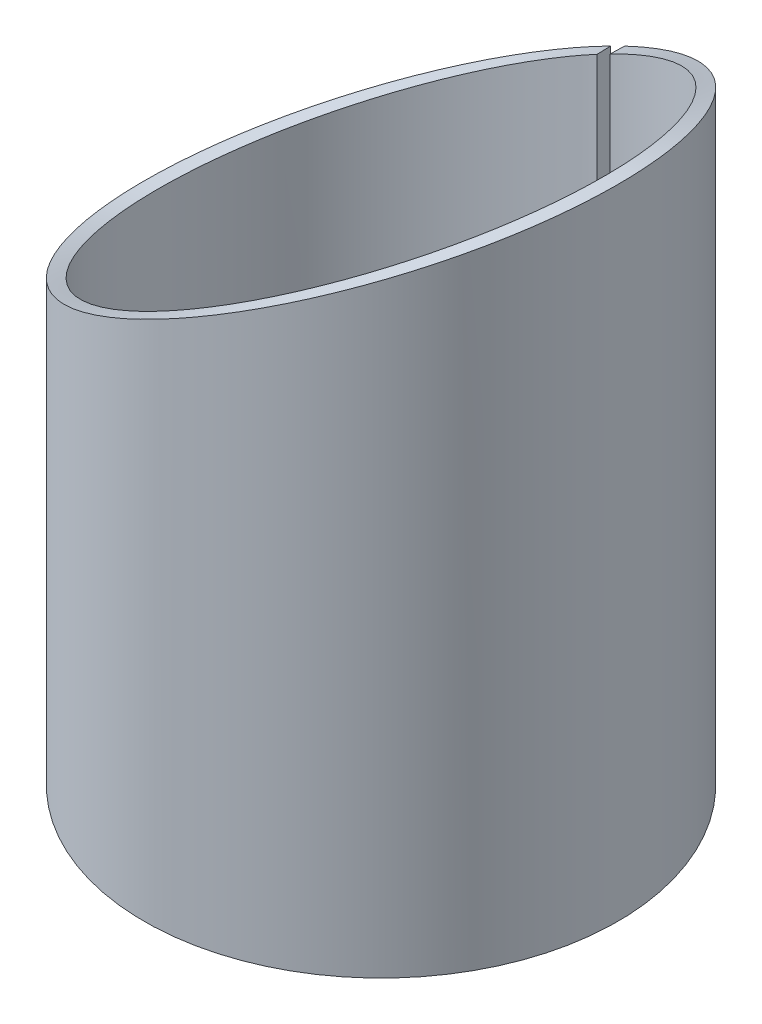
ISO-10303-21;
HEADER;
FILE_DESCRIPTION(('STEP AP214'),'2;1');
FILE_NAME('part.step','',(''),(''),'','','');
FILE_SCHEMA(('AUTOMOTIVE_DESIGN { 1 0 10303 214 1 1 1 1 }'));
ENDSEC;
DATA;
#1=APPLICATION_CONTEXT('core data for automotive mechanical design processes');
#2=APPLICATION_PROTOCOL_DEFINITION('international standard','automotive_design',2000,#1);
#3=PRODUCT_CONTEXT('',#1,'mechanical');
#4=PRODUCT('Part','Part','',(#3));
#5=PRODUCT_RELATED_PRODUCT_CATEGORY('part','',(#4));
#6=PRODUCT_DEFINITION_FORMATION('','',#4);
#7=PRODUCT_DEFINITION_CONTEXT('part definition',#1,'design');
#8=PRODUCT_DEFINITION('design','',#6,#7);
#9=PRODUCT_DEFINITION_SHAPE('','',#8);
#10=(LENGTH_UNIT() NAMED_UNIT(*) SI_UNIT(.MILLI.,.METRE.));
#11=(NAMED_UNIT(*) PLANE_ANGLE_UNIT() SI_UNIT($,.RADIAN.));
#12=(NAMED_UNIT(*) SI_UNIT($,.STERADIAN.) SOLID_ANGLE_UNIT());
#13=UNCERTAINTY_MEASURE_WITH_UNIT(LENGTH_MEASURE(1.E-05),#10,'distance_accuracy_value','');
#14=(GEOMETRIC_REPRESENTATION_CONTEXT(3) GLOBAL_UNCERTAINTY_ASSIGNED_CONTEXT((#13)) GLOBAL_UNIT_ASSIGNED_CONTEXT((#10,
#11,#12)) REPRESENTATION_CONTEXT('',''));
#15=CARTESIAN_POINT('',(0.,0.,0.));
#16=DIRECTION('',(0.,0.,1.));
#17=DIRECTION('',(1.,0.,0.));
#18=AXIS2_PLACEMENT_3D('',#15,#16,#17);
#19=CARTESIAN_POINT('',(36.5870512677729,-65.4896522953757,0.));
#20=DIRECTION('',(0.,-1.,0.));
#21=DIRECTION('',(0.,0.,-1.));
#22=AXIS2_PLACEMENT_3D('',#19,#20,#21);
#23=PLANE('',#22);
#24=DIRECTION('',(-0.0294512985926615,0.,-0.999566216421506));
#25=VECTOR('',#24,1.);
#26=CARTESIAN_POINT('',(36.1165025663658,-65.4896522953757,-15.970249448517));
#27=LINE('',#26,#25);
#28=CARTESIAN_POINT('',(36.1165025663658,-65.4896522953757,-15.970249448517));
#29=VERTEX_POINT('',#28);
#30=CARTESIAN_POINT('',(36.0870512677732,-65.4896522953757,-16.9698156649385));
#31=VERTEX_POINT('',#30);
#32=EDGE_CURVE('E13',#29,#31,#27,.T.);
#33=ORIENTED_EDGE('',*,*,#32,.F.);
#34=CARTESIAN_POINT('',(36.5870512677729,-65.4896522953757,0.));
#35=DIRECTION('',(0.,1.,0.));
#36=DIRECTION('',(0.,0.,1.));
#37=AXIS2_PLACEMENT_3D('',#34,#35,#36);
#38=CIRCLE('',#37,15.9771800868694);
#39=CARTESIAN_POINT('',(37.0575999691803,-65.4896522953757,-15.970249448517));
#40=VERTEX_POINT('',#39);
#41=EDGE_CURVE('E79',#29,#40,#38,.T.);
#42=ORIENTED_EDGE('',*,*,#41,.T.);
#43=DIRECTION('',(0.0294512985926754,0.,-0.999566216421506));
#44=VECTOR('',#43,1.);
#45=CARTESIAN_POINT('',(37.0575999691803,-65.4896522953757,-15.970249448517));
#46=LINE('',#45,#44);
#47=CARTESIAN_POINT('',(37.0870512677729,-65.4896522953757,-16.9698156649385));
#48=VERTEX_POINT('',#47);
#49=EDGE_CURVE('E48',#40,#48,#46,.T.);
#50=ORIENTED_EDGE('',*,*,#49,.T.);
#51=CARTESIAN_POINT('',(36.5870512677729,-65.4896522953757,0.));
#52=DIRECTION('',(0.,1.,0.));
#53=DIRECTION('',(0.,0.,1.));
#54=AXIS2_PLACEMENT_3D('',#51,#52,#53);
#55=CIRCLE('',#54,16.9771800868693);
#56=EDGE_CURVE('E81',#31,#48,#55,.T.);
#57=ORIENTED_EDGE('',*,*,#56,.F.);
#58=EDGE_LOOP('',(#33,#42,#50,#57));
#59=FACE_BOUND('',#58,.T.);
#60=ADVANCED_FACE('F36',(#59),#23,.T.);
#61=CARTESIAN_POINT('',(37.0575999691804,-46.6627139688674,-15.970249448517));
#62=DIRECTION('',(0.999566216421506,0.,0.0294512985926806));
#63=DIRECTION('',(0.,-1.,0.));
#64=AXIS2_PLACEMENT_3D('',#61,#62,#63);
#65=PLANE('',#64);
#66=ORIENTED_EDGE('',*,*,#49,.F.);
#67=DIRECTION('',(0.,-1.,0.));
#68=VECTOR('',#67,1.);
#69=CARTESIAN_POINT('',(37.0575999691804,-27.8357756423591,-15.970249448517));
#70=LINE('',#69,#68);
#71=CARTESIAN_POINT('',(37.0575999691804,-27.8357756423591,-15.970249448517));
#72=VERTEX_POINT('',#71);
#73=EDGE_CURVE('E88',#72,#40,#70,.T.);
#74=ORIENTED_EDGE('',*,*,#73,.F.);
#75=CARTESIAN_POINT('',(37.0870512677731,-27.8357756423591,-16.9698156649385));
#76=CARTESIAN_POINT('',(37.0575999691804,-27.8357756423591,-15.970249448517));
#77=B_SPLINE_CURVE_WITH_KNOTS('',1,(#75,#76),.UNSPECIFIED.,.F.,.F.,(2,2),(0.,1.),.UNSPECIFIED.);
#78=CARTESIAN_POINT('',(37.087051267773,-27.8357756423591,-16.9698156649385));
#79=VERTEX_POINT('',#78);
#80=EDGE_CURVE('E154',#72,#79,#77,.F.);
#81=ORIENTED_EDGE('',*,*,#80,.T.);
#82=DIRECTION('',(0.,1.,0.));
#83=VECTOR('',#82,1.);
#84=CARTESIAN_POINT('',(37.087051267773,-175.026799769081,-16.9698156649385));
#85=LINE('',#84,#83);
#86=EDGE_CURVE('E95',#79,#48,#85,.F.);
#87=ORIENTED_EDGE('',*,*,#86,.T.);
#88=EDGE_LOOP('',(#66,#74,#81,#87));
#89=FACE_BOUND('',#88,.T.);
#90=ADVANCED_FACE('F126',(#89),#65,.F.);
#91=CARTESIAN_POINT('',(36.0870512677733,-28.3288347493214,-16.9698156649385));
#92=CARTESIAN_POINT('',(35.4575269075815,-28.6391983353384,-16.951267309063));
#93=CARTESIAN_POINT('',(34.8914483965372,-28.9179611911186,-16.8998638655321));
#94=CARTESIAN_POINT('',(33.8883744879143,-29.4125509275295,-16.7689478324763));
#95=CARTESIAN_POINT('',(33.4513460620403,-29.6283335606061,-16.6894524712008));
#96=CARTESIAN_POINT('',(32.9843137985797,-29.8586715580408,-16.5907817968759));
#97=CARTESIAN_POINT('',(32.8946606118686,-29.9028679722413,-16.5710409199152));
#98=CARTESIAN_POINT('',(32.7148804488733,-29.9914963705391,-16.5299558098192));
#99=CARTESIAN_POINT('',(32.6257955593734,-30.0354097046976,-16.50882671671));
#100=CARTESIAN_POINT('',(32.3609694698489,-30.1659471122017,-16.4437807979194));
#101=CARTESIAN_POINT('',(32.187657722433,-30.2513685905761,-16.3982058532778));
#102=CARTESIAN_POINT('',(31.6775107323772,-30.5028226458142,-16.2556376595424));
#103=CARTESIAN_POINT('',(31.3504757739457,-30.6640448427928,-16.1528101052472));
#104=CARTESIAN_POINT('',(30.7225972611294,-30.9736615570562,-15.9355946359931));
#105=CARTESIAN_POINT('',(30.4217512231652,-31.1220560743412,-15.8212073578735));
#106=CARTESIAN_POINT('',(29.9899044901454,-31.3350270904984,-15.6437373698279));
#107=CARTESIAN_POINT('',(29.8491393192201,-31.4044356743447,-15.5835941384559));
#108=CARTESIAN_POINT('',(29.5705018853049,-31.5418158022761,-15.4601390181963));
#109=CARTESIAN_POINT('',(29.4330782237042,-31.609566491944,-15.3970071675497));
#110=CARTESIAN_POINT('',(28.7554859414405,-31.9436230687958,-15.074862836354));
#111=CARTESIAN_POINT('',(28.2439757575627,-32.1958383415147,-14.7964419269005));
#112=CARTESIAN_POINT('',(27.2820347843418,-32.6702089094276,-14.2112023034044));
#113=CARTESIAN_POINT('',(26.8322932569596,-32.891907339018,-13.9052464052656));
#114=CARTESIAN_POINT('',(25.9756725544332,-33.3142335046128,-13.2631000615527));
#115=CARTESIAN_POINT('',(25.5710340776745,-33.5137812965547,-12.928124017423));
#116=CARTESIAN_POINT('',(24.8088456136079,-33.8896462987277,-12.2377651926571));
#117=CARTESIAN_POINT('',(24.4518657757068,-34.0655998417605,-11.8831635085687));
#118=CARTESIAN_POINT('',(23.7766371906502,-34.3984672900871,-11.1519322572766));
#119=CARTESIAN_POINT('',(23.4593308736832,-34.5549298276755,-10.7760411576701));
#120=CARTESIAN_POINT('',(22.8652604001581,-34.8479125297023,-10.0086243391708));
#121=CARTESIAN_POINT('',(22.5889416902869,-34.9841828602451,-9.61781988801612));
#122=CARTESIAN_POINT('',(22.0738791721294,-35.2380984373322,-8.82141524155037));
#123=CARTESIAN_POINT('',(21.8349640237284,-35.3558734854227,-8.41539116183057));
#124=CARTESIAN_POINT('',(21.3945018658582,-35.5730581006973,-7.59139836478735));
#125=CARTESIAN_POINT('',(21.192953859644,-35.6724676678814,-7.17343058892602));
#126=CARTESIAN_POINT('',(20.8270154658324,-35.8529213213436,-6.3291083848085));
#127=CARTESIAN_POINT('',(20.6621983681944,-35.9341093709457,-5.90190774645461));
#128=CARTESIAN_POINT('',(19.9261370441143,-36.2964140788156,-3.73892503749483));
#129=CARTESIAN_POINT('',(19.6253272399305,-36.4451360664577,-1.93151938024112));
#130=CARTESIAN_POINT('',(19.6067390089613,-36.4546363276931,0.306638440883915));
#131=CARTESIAN_POINT('',(19.6206568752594,-36.4477153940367,0.753349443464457));
#132=CARTESIAN_POINT('',(19.6841581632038,-36.4161698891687,1.64872034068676));
#133=CARTESIAN_POINT('',(19.7337690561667,-36.3915532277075,2.0965324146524));
#134=CARTESIAN_POINT('',(19.9366967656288,-36.2911715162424,3.43599210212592));
#135=CARTESIAN_POINT('',(20.1442344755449,-36.1888747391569,4.32368711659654));
#136=CARTESIAN_POINT('',(20.5638002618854,-35.9823661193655,5.62930133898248));
#137=CARTESIAN_POINT('',(20.7216677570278,-35.9046860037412,6.06017771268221));
#138=CARTESIAN_POINT('',(21.0730235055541,-35.7316379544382,6.91021638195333));
#139=CARTESIAN_POINT('',(21.2662440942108,-35.6363511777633,7.32900446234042));
#140=CARTESIAN_POINT('',(21.690980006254,-35.4268756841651,8.15772638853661));
#141=CARTESIAN_POINT('',(21.9222328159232,-35.3128276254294,8.56691592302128));
#142=CARTESIAN_POINT('',(22.4226470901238,-35.0661108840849,9.37115803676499));
#143=CARTESIAN_POINT('',(22.6913932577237,-34.9336623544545,9.7656613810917));
#144=CARTESIAN_POINT('',(23.5570080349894,-34.5068621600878,10.9258343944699));
#145=CARTESIAN_POINT('',(24.2168527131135,-34.1814123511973,11.6723253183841));
#146=CARTESIAN_POINT('',(25.3316985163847,-33.6318631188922,12.720132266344));
#147=CARTESIAN_POINT('',(25.7266249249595,-33.4370717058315,13.059853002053));
#148=CARTESIAN_POINT('',(26.5670664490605,-33.0226198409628,13.715266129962));
#149=CARTESIAN_POINT('',(27.0120981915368,-32.8032233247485,14.0304911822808));
#150=CARTESIAN_POINT('',(27.7167227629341,-32.455872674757,14.4782373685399));
#151=CARTESIAN_POINT('',(27.9584326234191,-32.3366928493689,14.6237703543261));
#152=CARTESIAN_POINT('',(28.4598087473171,-32.0894407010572,14.9082409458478));
#153=CARTESIAN_POINT('',(28.7188854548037,-31.9616748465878,15.0467975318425));
#154=CARTESIAN_POINT('',(29.2539204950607,-31.6978635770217,15.3146773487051));
#155=CARTESIAN_POINT('',(29.5298794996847,-31.561818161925,15.4440003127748));
#156=CARTESIAN_POINT('',(29.9564418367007,-31.3515403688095,15.629577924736));
#157=CARTESIAN_POINT('',(30.1007319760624,-31.280412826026,15.6900352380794));
#158=CARTESIAN_POINT('',(30.393495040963,-31.1360878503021,15.8078905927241));
#159=CARTESIAN_POINT('',(30.5414804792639,-31.0631314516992,15.8651237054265));
#160=CARTESIAN_POINT('',(31.3038409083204,-30.68717385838,16.1472986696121));
#161=CARTESIAN_POINT('',(31.9783315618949,-30.3544757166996,16.3573084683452));
#162=CARTESIAN_POINT('',(32.9030082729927,-29.8986879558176,16.5737305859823));
#163=CARTESIAN_POINT('',(33.0920008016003,-29.8055346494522,16.6146918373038));
#164=CARTESIAN_POINT('',(33.3332675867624,-29.686598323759,16.6625314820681));
#165=CARTESIAN_POINT('',(33.3817721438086,-29.6626863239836,16.6719312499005));
#166=CARTESIAN_POINT('',(33.4792820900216,-29.6146128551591,16.6903827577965));
#167=CARTESIAN_POINT('',(33.5281515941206,-29.5905185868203,16.6994156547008));
#168=CARTESIAN_POINT('',(33.6817611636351,-29.5147499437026,16.7270666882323));
#169=CARTESIAN_POINT('',(33.7914555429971,-29.4606119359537,16.745845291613));
#170=CARTESIAN_POINT('',(34.3766186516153,-29.1717940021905,16.8393400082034));
#171=CARTESIAN_POINT('',(34.9625905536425,-28.8827303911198,16.9140032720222));
#172=CARTESIAN_POINT('',(35.8431744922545,-28.4488892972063,16.9617923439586));
#173=CARTESIAN_POINT('',(36.0266655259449,-28.3584954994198,16.9690020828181));
#174=CARTESIAN_POINT('',(36.3128587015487,-28.2174664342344,16.9752339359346));
#175=CARTESIAN_POINT('',(36.4100818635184,-28.1695503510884,16.9765465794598));
#176=CARTESIAN_POINT('',(36.6081528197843,-28.0719053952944,16.9774558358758));
#177=CARTESIAN_POINT('',(36.7084217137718,-28.0224665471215,16.9770251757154));
#178=CARTESIAN_POINT('',(37.1949740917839,-27.7826609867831,16.9707574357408));
#179=CARTESIAN_POINT('',(37.5551708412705,-27.6052643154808,16.9527983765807));
#180=CARTESIAN_POINT('',(38.5471729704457,-27.116417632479,16.8766852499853));
#181=CARTESIAN_POINT('',(39.0901523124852,-26.8483109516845,16.7972138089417));
#182=CARTESIAN_POINT('',(39.6229627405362,-26.5854164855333,16.7038794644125));
#183=CARTESIAN_POINT('',(39.7203957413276,-26.537376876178,16.6858225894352));
#184=CARTESIAN_POINT('',(39.9155527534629,-26.4411603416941,16.6479908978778));
#185=CARTESIAN_POINT('',(40.0121308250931,-26.3935503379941,16.6283799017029));
#186=CARTESIAN_POINT('',(40.2988462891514,-26.2522151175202,16.567600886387));
#187=CARTESIAN_POINT('',(40.4859636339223,-26.1599846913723,16.5244876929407));
#188=CARTESIAN_POINT('',(41.0351461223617,-25.8892725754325,16.3884522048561));
#189=CARTESIAN_POINT('',(41.3850244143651,-25.7167700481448,16.2888487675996));
#190=CARTESIAN_POINT('',(42.0522725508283,-25.3877094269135,16.077266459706));
#191=CARTESIAN_POINT('',(42.3696467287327,-25.23115133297,15.9652884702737));
#192=CARTESIAN_POINT('',(42.9723756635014,-24.933979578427,15.7339276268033));
#193=CARTESIAN_POINT('',(43.2641277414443,-24.7901731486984,15.6121118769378));
#194=CARTESIAN_POINT('',(44.1152007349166,-24.370615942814,15.2295300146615));
#195=CARTESIAN_POINT('',(44.6481068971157,-24.1078059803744,14.9525073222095));
#196=CARTESIAN_POINT('',(45.3961299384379,-23.7389332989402,14.5157893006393));
#197=CARTESIAN_POINT('',(45.6363130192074,-23.6205296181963,14.3671099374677));
#198=CARTESIAN_POINT('',(46.1049980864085,-23.3894863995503,14.0609983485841));
#199=CARTESIAN_POINT('',(46.3330520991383,-23.2770622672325,13.9037817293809));
#200=CARTESIAN_POINT('',(46.9982752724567,-22.9490823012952,13.4212964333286));
#201=CARTESIAN_POINT('',(47.4164718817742,-22.7428188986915,13.0852140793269));
#202=CARTESIAN_POINT('',(48.202781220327,-22.3550719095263,12.3924975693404));
#203=CARTESIAN_POINT('',(48.5715118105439,-22.1733416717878,12.035562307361));
#204=CARTESIAN_POINT('',(49.2688392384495,-21.8295440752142,11.2984206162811));
#205=CARTESIAN_POINT('',(49.5961982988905,-21.6681013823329,10.9192624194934));
#206=CARTESIAN_POINT('',(50.2085227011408,-21.3661282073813,10.1451325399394));
#207=CARTESIAN_POINT('',(50.49318455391,-21.2258031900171,9.7507468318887));
#208=CARTESIAN_POINT('',(51.0247040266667,-20.9637802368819,8.94493094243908));
#209=CARTESIAN_POINT('',(51.2710373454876,-20.8423246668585,8.5340737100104));
#210=CARTESIAN_POINT('',(51.7248484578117,-20.6185253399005,7.70045176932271));
#211=CARTESIAN_POINT('',(51.9320898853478,-20.5162861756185,7.27823834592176));
#212=CARTESIAN_POINT('',(52.3091819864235,-20.3304424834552,6.42320552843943));
#213=CARTESIAN_POINT('',(52.4794935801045,-20.2466185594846,5.98920633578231));
#214=CARTESIAN_POINT('',(52.9349744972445,-20.0224405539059,4.6725513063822));
#215=CARTESIAN_POINT('',(53.1645574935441,-19.909380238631,3.77526470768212));
#216=CARTESIAN_POINT('',(53.4748566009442,-19.7560429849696,1.96681654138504));
#217=CARTESIAN_POINT('',(53.5555809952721,-19.7157752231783,1.05661995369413));
#218=CARTESIAN_POINT('',(53.5715639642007,-19.7079849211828,-0.757479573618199));
#219=CARTESIAN_POINT('',(53.5067428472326,-19.7403799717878,-1.66996881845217));
#220=CARTESIAN_POINT('',(53.228599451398,-19.8777504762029,-3.48190078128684));
#221=CARTESIAN_POINT('',(53.015266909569,-19.9827259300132,-4.38132197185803));
#222=CARTESIAN_POINT('',(52.4412265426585,-20.2652572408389,-6.14226161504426));
#223=CARTESIAN_POINT('',(52.0819747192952,-20.4424593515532,-7.0018860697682));
#224=CARTESIAN_POINT('',(51.4268079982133,-20.7655410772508,-8.26013730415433));
#225=CARTESIAN_POINT('',(51.1891891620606,-20.8826826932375,-8.67368416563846));
#226=CARTESIAN_POINT('',(50.675573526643,-21.1358613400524,-9.48518680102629));
#227=CARTESIAN_POINT('',(50.3997737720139,-21.2718376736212,-9.88304034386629));
#228=CARTESIAN_POINT('',(49.8054229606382,-21.564958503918,-10.6649162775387));
#229=CARTESIAN_POINT('',(49.4873383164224,-21.7218216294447,-11.0481350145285));
#230=CARTESIAN_POINT('',(48.809181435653,-22.0561533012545,-11.7939911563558));
#231=CARTESIAN_POINT('',(48.4502143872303,-22.2330721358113,-12.15569699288));
#232=CARTESIAN_POINT('',(47.6832103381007,-22.6113103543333,-12.8596602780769));
#233=CARTESIAN_POINT('',(47.2753965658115,-22.8124393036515,-13.2014471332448));
#234=CARTESIAN_POINT('',(46.6269369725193,-23.1321474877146,-13.6930241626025));
#235=CARTESIAN_POINT('',(46.4046683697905,-23.2417193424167,-13.8533611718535));
#236=CARTESIAN_POINT('',(45.9479556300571,-23.4668679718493,-14.1659694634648));
#237=CARTESIAN_POINT('',(45.7133367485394,-23.5825443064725,-14.318406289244));
#238=CARTESIAN_POINT('',(44.9848326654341,-23.9417671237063,-14.7657278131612));
#239=CARTESIAN_POINT('',(44.4682444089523,-24.196468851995,-15.0492503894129));
#240=CARTESIAN_POINT('',(43.6470218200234,-24.6013512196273,-15.4425899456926));
#241=CARTESIAN_POINT('',(43.366591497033,-24.7396199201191,-15.5679528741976));
#242=CARTESIAN_POINT('',(42.7860350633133,-25.0259637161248,-15.8080967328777));
#243=CARTESIAN_POINT('',(42.4828001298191,-25.1755436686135,-15.9241002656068));
#244=CARTESIAN_POINT('',(41.8501419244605,-25.4875196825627,-16.1442466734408));
#245=CARTESIAN_POINT('',(41.5207161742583,-25.6499157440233,-16.2483888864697));
#246=CARTESIAN_POINT('',(41.0069968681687,-25.9031219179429,-16.392692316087));
#247=CARTESIAN_POINT('',(40.8324967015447,-25.9891259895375,-16.4388062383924));
#248=CARTESIAN_POINT('',(40.5658937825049,-26.1205351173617,-16.5046004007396));
#249=CARTESIAN_POINT('',(40.476217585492,-26.1647386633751,-16.5259688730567));
#250=CARTESIAN_POINT('',(40.2952571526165,-26.2539467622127,-16.5675125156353));
#251=CARTESIAN_POINT('',(40.204969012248,-26.298455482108,-16.5874797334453));
#252=CARTESIAN_POINT('',(39.7366236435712,-26.5294299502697,-16.6868673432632));
#253=CARTESIAN_POINT('',(39.2978448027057,-26.7460801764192,-16.7670702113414));
#254=CARTESIAN_POINT('',(38.2898063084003,-27.2431219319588,-16.8992209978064));
#255=CARTESIAN_POINT('',(37.7205122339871,-27.5234682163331,-16.9511513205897));
#256=CARTESIAN_POINT('',(37.0870512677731,-27.8357756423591,-16.9698156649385));
#257=CARTESIAN_POINT('',(36.116502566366,-28.3288347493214,-15.970249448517));
#258=CARTESIAN_POINT('',(35.5240609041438,-28.6391972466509,-15.9527937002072));
#259=CARTESIAN_POINT('',(34.991323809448,-28.9179611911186,-15.9044179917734));
#260=CARTESIAN_POINT('',(34.0473335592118,-29.4125509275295,-15.7812132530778));
#261=CARTESIAN_POINT('',(33.6360472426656,-29.6283335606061,-15.7064003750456));
#262=CARTESIAN_POINT('',(33.1965243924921,-29.8586715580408,-15.6135416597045));
#263=CARTESIAN_POINT('',(33.1121520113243,-29.9028679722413,-15.5949635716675));
#264=CARTESIAN_POINT('',(32.9429613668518,-29.9914963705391,-15.5562984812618));
#265=CARTESIAN_POINT('',(32.8591238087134,-30.0354097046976,-15.5364139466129));
#266=CARTESIAN_POINT('',(32.6098966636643,-30.1659471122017,-15.4751994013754));
#267=CARTESIAN_POINT('',(32.446793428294,-30.2513685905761,-15.4323089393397));
#268=CARTESIAN_POINT('',(31.9666954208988,-30.5028226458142,-15.2981383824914));
#269=CARTESIAN_POINT('',(31.6589236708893,-30.6640448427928,-15.2013676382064));
#270=CARTESIAN_POINT('',(31.0680288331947,-30.9736615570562,-14.9969467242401));
#271=CARTESIAN_POINT('',(30.7849034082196,-31.1220560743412,-14.8892971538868));
#272=CARTESIAN_POINT('',(30.3784935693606,-31.3350270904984,-14.7222806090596));
#273=CARTESIAN_POINT('',(30.2460198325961,-31.4044356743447,-14.6656799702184));
#274=CARTESIAN_POINT('',(29.9837948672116,-31.5418158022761,-14.549496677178));
#275=CARTESIAN_POINT('',(29.8544658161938,-31.609566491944,-14.4900834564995));
#276=CARTESIAN_POINT('',(29.2167854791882,-31.9436230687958,-14.1869142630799));
#277=CARTESIAN_POINT('',(28.7354045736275,-32.1958383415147,-13.9248930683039));
#278=CARTESIAN_POINT('',(27.8301244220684,-32.6702089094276,-13.3741255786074));
#279=CARTESIAN_POINT('',(27.4068738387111,-32.891907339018,-13.0861912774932));
#280=CARTESIAN_POINT('',(26.6007103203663,-33.3142335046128,-12.4818690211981));
#281=CARTESIAN_POINT('',(26.2199061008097,-33.5137812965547,-12.1666239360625));
#282=CARTESIAN_POINT('',(25.5026125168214,-33.8896462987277,-11.5169290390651));
#283=CARTESIAN_POINT('',(25.1666597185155,-34.0655998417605,-11.1832143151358));
#284=CARTESIAN_POINT('',(24.5312038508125,-34.3984672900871,-10.4950544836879));
#285=CARTESIAN_POINT('',(24.2325877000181,-34.5549298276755,-10.1413043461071));
#286=CARTESIAN_POINT('',(23.6735095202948,-34.8479125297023,-9.41909037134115));
#287=CARTESIAN_POINT('',(23.413466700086,-34.9841828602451,-9.05130531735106));
#288=CARTESIAN_POINT('',(22.9287427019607,-35.2380984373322,-8.30181097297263));
#289=CARTESIAN_POINT('',(22.7039002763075,-35.3558734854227,-7.91970276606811));
#290=CARTESIAN_POINT('',(22.2893824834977,-35.5730581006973,-7.14424528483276));
#291=CARTESIAN_POINT('',(22.0997061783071,-35.6724676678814,-6.75089689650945));
#292=CARTESIAN_POINT('',(21.7553225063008,-35.8529213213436,-5.9563074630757));
#293=CARTESIAN_POINT('',(21.6002135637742,-35.9341093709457,-5.5542700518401));
#294=CARTESIAN_POINT('',(20.9075081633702,-36.2964140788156,-3.51869264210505));
#295=CARTESIAN_POINT('',(20.6244168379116,-36.4451360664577,-1.81774787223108));
#296=CARTESIAN_POINT('',(20.6069235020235,-36.4546363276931,0.288576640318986));
#297=CARTESIAN_POINT('',(20.6200215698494,-36.4477153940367,0.708975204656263));
#298=CARTESIAN_POINT('',(20.6797824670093,-36.4161698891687,1.551606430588));
#299=CARTESIAN_POINT('',(20.726471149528,-36.3915532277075,1.9730412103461));
#300=CARTESIAN_POINT('',(20.9174458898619,-36.2911715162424,3.23360324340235));
#301=CARTESIAN_POINT('',(21.11275908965,-36.1888747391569,4.06901071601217));
#302=CARTESIAN_POINT('',(21.507611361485,-35.9823661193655,5.29772086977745));
#303=CARTESIAN_POINT('',(21.6561800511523,-35.9046860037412,5.70321750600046));
#304=CARTESIAN_POINT('',(21.9868400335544,-35.7316379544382,6.50318668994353));
#305=CARTESIAN_POINT('',(22.1686794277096,-35.6363511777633,6.89730706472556));
#306=CARTESIAN_POINT('',(22.5683972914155,-35.4268756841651,7.67721511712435));
#307=CARTESIAN_POINT('',(22.7860287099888,-35.3128276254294,8.0623023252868));
#308=CARTESIAN_POINT('',(23.2569672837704,-35.0661108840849,8.81917248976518));
#309=CARTESIAN_POINT('',(23.509883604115,-34.9336623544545,9.19043856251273));
#310=CARTESIAN_POINT('',(24.3245114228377,-34.5068621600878,10.2822743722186));
#311=CARTESIAN_POINT('',(24.9454895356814,-34.1814123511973,10.9847950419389));
#312=CARTESIAN_POINT('',(25.9946680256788,-33.6318631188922,11.9708834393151));
#313=CARTESIAN_POINT('',(26.3663322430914,-33.4370717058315,12.2905937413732));
#314=CARTESIAN_POINT('',(27.1572695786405,-33.0226198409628,12.907401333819));
#315=CARTESIAN_POINT('',(27.5760877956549,-32.8032233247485,13.2040588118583));
#316=CARTESIAN_POINT('',(28.2392081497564,-32.455872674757,13.6254315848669));
#317=CARTESIAN_POINT('',(28.4666806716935,-32.3366928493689,13.7623922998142));
#318=CARTESIAN_POINT('',(28.9385244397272,-32.0894407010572,14.0301068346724));
#319=CARTESIAN_POINT('',(29.1823408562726,-31.9616748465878,14.1605020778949));
#320=CARTESIAN_POINT('',(29.6858609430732,-31.6978635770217,14.4126030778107));
#321=CARTESIAN_POINT('',(29.9455652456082,-31.561818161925,14.5343085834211));
#322=CARTESIAN_POINT('',(30.3470019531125,-31.3515403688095,14.7089551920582));
#323=CARTESIAN_POINT('',(30.4827930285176,-31.280412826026,14.7658514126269));
#324=CARTESIAN_POINT('',(30.7583115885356,-31.1360878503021,14.8767647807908));
#325=CARTESIAN_POINT('',(30.8975803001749,-31.0631314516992,14.9306267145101));
#326=CARTESIAN_POINT('',(31.6150357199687,-30.68717385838,15.1961808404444));
#327=CARTESIAN_POINT('',(32.2497971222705,-30.3544757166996,15.3938205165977));
#328=CARTESIAN_POINT('',(33.1200079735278,-29.8986879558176,15.5974948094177));
#329=CARTESIAN_POINT('',(33.2978683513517,-29.8055346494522,15.6360433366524));
#330=CARTESIAN_POINT('',(33.5249238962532,-29.686598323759,15.6810651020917));
#331=CARTESIAN_POINT('',(33.5705714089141,-29.6626863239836,15.6899111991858));
#332=CARTESIAN_POINT('',(33.6623377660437,-29.6146128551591,15.7072758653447));
#333=CARTESIAN_POINT('',(33.7083287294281,-29.5905185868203,15.7157767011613));
#334=CARTESIAN_POINT('',(33.8528902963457,-29.5147499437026,15.7417990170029));
#335=CARTESIAN_POINT('',(33.9561233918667,-29.4606119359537,15.7594715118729));
#336=CARTESIAN_POINT('',(34.5068188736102,-29.1717940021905,15.847459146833));
#337=CARTESIAN_POINT('',(35.0582755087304,-28.8827303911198,15.9177245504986));
#338=CARTESIAN_POINT('',(35.8869907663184,-28.4488892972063,15.9626987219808));
#339=CARTESIAN_POINT('',(36.0596737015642,-28.3584954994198,15.9694837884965));
#340=CARTESIAN_POINT('',(36.3290093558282,-28.2174664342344,15.9753485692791));
#341=CARTESIAN_POINT('',(36.4205058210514,-28.1695503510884,15.9765838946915));
#342=CARTESIAN_POINT('',(36.6069098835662,-28.0719053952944,15.9774395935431));
#343=CARTESIAN_POINT('',(36.7012726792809,-28.0224665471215,15.9770343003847));
#344=CARTESIAN_POINT('',(37.1591658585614,-27.7826609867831,15.9711357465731));
#345=CARTESIAN_POINT('',(37.4981460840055,-27.6052643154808,15.9542345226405));
#346=CARTESIAN_POINT('',(38.4317167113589,-27.116417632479,15.8826046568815));
#347=CARTESIAN_POINT('',(38.9427131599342,-26.8483109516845,15.8078142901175));
#348=CARTESIAN_POINT('',(39.4441396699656,-26.5854164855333,15.7199775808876));
#349=CARTESIAN_POINT('',(39.5358336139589,-26.537376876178,15.7029843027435));
#350=CARTESIAN_POINT('',(39.7194953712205,-26.4411603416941,15.6673809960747));
#351=CARTESIAN_POINT('',(39.8103847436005,-26.3935503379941,15.648925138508));
#352=CARTESIAN_POINT('',(40.0802119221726,-26.2522151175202,15.5917261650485));
#353=CARTESIAN_POINT('',(40.2563075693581,-26.1599846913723,15.5511524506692));
#354=CARTESIAN_POINT('',(40.7731417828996,-25.8892725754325,15.4231298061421));
#355=CARTESIAN_POINT('',(41.1024113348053,-25.7167700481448,15.3293932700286));
#356=CARTESIAN_POINT('',(41.7303568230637,-25.3877094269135,15.1302737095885));
#357=CARTESIAN_POINT('',(42.0290368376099,-25.23115133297,15.0248915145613));
#358=CARTESIAN_POINT('',(42.596263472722,-24.933979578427,14.8071584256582));
#359=CARTESIAN_POINT('',(42.8708305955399,-24.7901731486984,14.6925179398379));
#360=CARTESIAN_POINT('',(43.6717731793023,-24.370615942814,14.3324711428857));
#361=CARTESIAN_POINT('',(44.1732897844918,-24.1078059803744,14.0717658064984));
#362=CARTESIAN_POINT('',(44.8772523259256,-23.7389332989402,13.6607716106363));
#363=CARTESIAN_POINT('',(45.1032879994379,-23.6205296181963,13.5208498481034));
#364=CARTESIAN_POINT('',(45.5443662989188,-23.3894863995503,13.2327690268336));
#365=CARTESIAN_POINT('',(45.7589873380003,-23.2770622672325,13.0848128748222));
#366=CARTESIAN_POINT('',(46.3850271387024,-22.9490823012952,12.6307472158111));
#367=CARTESIAN_POINT('',(46.7785908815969,-22.7428188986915,12.3144609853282));
#368=CARTESIAN_POINT('',(47.5185845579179,-22.3550719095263,11.6625472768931));
#369=CARTESIAN_POINT('',(47.8655959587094,-22.1733416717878,11.3266364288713));
#370=CARTESIAN_POINT('',(48.5218489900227,-21.8295440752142,10.6329142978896));
#371=CARTESIAN_POINT('',(48.8299257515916,-21.6681013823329,10.2760895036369));
#372=CARTESIAN_POINT('',(49.4061826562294,-21.3661282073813,9.5475578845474));
#373=CARTESIAN_POINT('',(49.6740771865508,-21.2258031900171,9.17640251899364));
#374=CARTESIAN_POINT('',(50.1742887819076,-20.9637802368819,8.41805127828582));
#375=CARTESIAN_POINT('',(50.4061124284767,-20.8423246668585,8.03139460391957));
#376=CARTESIAN_POINT('',(50.8331928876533,-20.6185253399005,7.24687516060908));
#377=CARTESIAN_POINT('',(51.0282272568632,-20.5162861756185,6.84953120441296));
#378=CARTESIAN_POINT('',(51.3831076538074,-20.3304424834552,6.04486204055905));
#379=CARTESIAN_POINT('',(51.5433874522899,-20.2466185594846,5.63642652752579));
#380=CARTESIAN_POINT('',(51.9720393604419,-20.0224405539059,4.39732589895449));
#381=CARTESIAN_POINT('',(52.1880993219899,-19.909380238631,3.55289181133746));
#382=CARTESIAN_POINT('',(52.4801210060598,-19.7560429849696,1.85096593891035));
#383=CARTESIAN_POINT('',(52.5560905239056,-19.7157752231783,0.994382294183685));
#384=CARTESIAN_POINT('',(52.5711320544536,-19.7079849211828,-0.712862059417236));
#385=CARTESIAN_POINT('',(52.5101290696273,-19.7403799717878,-1.57160331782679));
#386=CARTESIAN_POINT('',(52.2483690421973,-19.8777504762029,-3.27680778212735));
#387=CARTESIAN_POINT('',(52.0476023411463,-19.9827259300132,-4.12325072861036));
#388=CARTESIAN_POINT('',(51.507374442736,-20.2652572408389,-5.78046645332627));
#389=CARTESIAN_POINT('',(51.1692834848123,-20.4424593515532,-6.58945679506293));
#390=CARTESIAN_POINT('',(50.5527077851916,-20.7655410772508,-7.77359376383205));
#391=CARTESIAN_POINT('',(50.3290853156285,-20.8826826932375,-8.16278164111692));
#392=CARTESIAN_POINT('',(49.8457229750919,-21.1358613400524,-8.92648466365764));
#393=CARTESIAN_POINT('',(49.5861685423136,-21.2718376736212,-9.30090359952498));
#394=CARTESIAN_POINT('',(49.0268265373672,-21.564958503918,-10.0367250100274));
#395=CARTESIAN_POINT('',(48.7274779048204,-21.7218216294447,-10.3973711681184));
#396=CARTESIAN_POINT('',(48.0892662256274,-22.0561533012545,-11.0992944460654));
#397=CARTESIAN_POINT('',(47.7514432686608,-22.2330721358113,-11.4396948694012));
#398=CARTESIAN_POINT('',(47.0296177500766,-22.6113103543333,-12.1021928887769));
#399=CARTESIAN_POINT('',(46.6458252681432,-22.8124393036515,-12.4238476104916));
#400=CARTESIAN_POINT('',(46.0355616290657,-23.1321474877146,-12.8864694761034));
#401=CARTESIAN_POINT('',(45.8263852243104,-23.2417193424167,-13.0373622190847));
#402=CARTESIAN_POINT('',(45.3965740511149,-23.4668679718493,-13.3315570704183));
#403=CARTESIAN_POINT('',(45.1757748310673,-23.5825443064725,-13.4750149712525));
#404=CARTESIAN_POINT('',(44.490181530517,-23.9417671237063,-13.895988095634));
#405=CARTESIAN_POINT('',(44.0040216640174,-24.196468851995,-14.1628104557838));
#406=CARTESIAN_POINT('',(43.2311712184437,-24.6013512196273,-14.5329812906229));
#407=CARTESIAN_POINT('',(42.967258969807,-24.7396199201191,-14.6509600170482));
#408=CARTESIAN_POINT('',(42.4208988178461,-25.0259637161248,-14.876958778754));
#409=CARTESIAN_POINT('',(42.135525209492,-25.1755436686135,-14.9861294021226));
#410=CARTESIAN_POINT('',(41.5401322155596,-25.4875196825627,-15.1933086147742));
#411=CARTESIAN_POINT('',(41.2301104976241,-25.6499157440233,-15.291316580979));
#412=CARTESIAN_POINT('',(40.7466505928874,-25.9031219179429,-15.4271201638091));
#413=CARTESIAN_POINT('',(40.5824289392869,-25.9891259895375,-15.4705178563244));
#414=CARTESIAN_POINT('',(40.3315296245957,-26.1205351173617,-15.5324365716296));
#415=CARTESIAN_POINT('',(40.2471355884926,-26.1647386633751,-15.5525463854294));
#416=CARTESIAN_POINT('',(40.0768341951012,-26.2539467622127,-15.5916429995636));
#417=CARTESIAN_POINT('',(39.9918642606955,-26.298455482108,-15.610434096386));
#418=CARTESIAN_POINT('',(39.5511056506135,-26.5294299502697,-15.7039675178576));
#419=CARTESIAN_POINT('',(39.1381720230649,-26.7460801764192,-15.7794462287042));
#420=CARTESIAN_POINT('',(38.1895096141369,-27.2431219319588,-15.9038129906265));
#421=CARTESIAN_POINT('',(37.6537463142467,-27.5234693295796,-15.9526845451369));
#422=CARTESIAN_POINT('',(37.0575999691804,-27.8357756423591,-15.970249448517));
#423=B_SPLINE_SURFACE_WITH_KNOTS('',1,3,((#91,#92,#93,#94,#95,#96,#97,#98,#99,#100,#101,#102,
#103,#104,#105,#106,#107,#108,#109,#110,#111,#112,#113,#114,#115,#116,#117,#118,#119,#120,#121,
#122,#123,#124,#125,#126,#127,#128,#129,#130,#131,#132,#133,#134,#135,#136,#137,#138,#139,#140,
#141,#142,#143,#144,#145,#146,#147,#148,#149,#150,#151,#152,#153,#154,#155,#156,#157,#158,#159,
#160,#161,#162,#163,#164,#165,#166,#167,#168,#169,#170,#171,#172,#173,#174,#175,#176,#177,#178,
#179,#180,#181,#182,#183,#184,#185,#186,#187,#188,#189,#190,#191,#192,#193,#194,#195,#196,#197,
#198,#199,#200,#201,#202,#203,#204,#205,#206,#207,#208,#209,#210,#211,#212,#213,#214,#215,#216,
#217,#218,#219,#220,#221,#222,#223,#224,#225,#226,#227,#228,#229,#230,#231,#232,#233,#234,#235,
#236,#237,#238,#239,#240,#241,#242,#243,#244,#245,#246,#247,#248,#249,#250,#251,#252,#253,#254,
#255,#256),(#257,#258,#259,#260,#261,#262,#263,#264,#265,#266,#267,#268,#269,#270,#271,#272,
#273,#274,#275,#276,#277,#278,#279,#280,#281,#282,#283,#284,#285,#286,#287,#288,#289,#290,#291,
#292,#293,#294,#295,#296,#297,#298,#299,#300,#301,#302,#303,#304,#305,#306,#307,#308,#309,#310,
#311,#312,#313,#314,#315,#316,#317,#318,#319,#320,#321,#322,#323,#324,#325,#326,#327,#328,#329,
#330,#331,#332,#333,#334,#335,#336,#337,#338,#339,#340,#341,#342,#343,#344,#345,#346,#347,#348,
#349,#350,#351,#352,#353,#354,#355,#356,#357,#358,#359,#360,#361,#362,#363,#364,#365,#366,#367,
#368,#369,#370,#371,#372,#373,#374,#375,#376,#377,#378,#379,#380,#381,#382,#383,#384,#385,#386,
#387,#388,#389,#390,#391,#392,#393,#394,#395,#396,#397,#398,#399,#400,#401,#402,#403,#404,#405,
#406,#407,#408,#409,#410,#411,#412,#413,#414,#415,#416,#417,#418,#419,#420,#421,#422)),
.UNSPECIFIED.,.F.,.F.,.F.,(2,2),(4,2,2,2,2,2,2,2,2,2,2,2,2,2,2,2,2,2,2,2,2,2,2,2,2,2,2,2,2,2,2,
2,2,2,2,2,2,2,2,2,2,2,2,2,2,2,2,2,2,2,2,2,2,2,2,2,2,2,2,2,2,2,2,2,2,2,2,2,2,2,2,2,2,2,2,2,2,2,2,
2,2,2,4),(0.,1.),(0.,0.0078125,0.015625,0.017578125,0.01953125,0.0234375,0.03125,0.0390625,
0.04296875,0.046875,0.0625,0.078125,0.09375,0.109375,0.125,0.140625,0.15625,0.171875,0.1875,
0.25,0.265625,0.28125,0.3125,0.328125,0.34375,0.359375,0.375,0.40625,0.421875,0.4375,0.4453125,
0.453125,0.4609375,0.46484375,0.46875,0.484375,0.48828125,0.4892578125,0.490234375,0.4921875,
0.5,0.501953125,0.5029296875,0.50390625,0.5078125,0.515625,0.517578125,0.51953125,0.5234375,
0.53125,0.5390625,0.546875,0.5625,0.5703125,0.578125,0.59375,0.609375,0.625,0.640625,0.65625,
0.671875,0.6875,0.71875,0.75,0.78125,0.8125,0.84375,0.859375,0.875,0.890625,0.90625,0.921875,
0.9296875,0.9375,0.953125,0.9609375,0.96875,0.9765625,0.98046875,0.982421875,0.984375,0.9921875,
1.),.UNSPECIFIED.);
#424=CARTESIAN_POINT('',(37.0575999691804,-27.8357756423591,-15.970249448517));
#425=CARTESIAN_POINT('',(37.6537463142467,-27.5234693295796,-15.9526845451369));
#426=CARTESIAN_POINT('',(38.1895096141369,-27.2431219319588,-15.9038129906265));
#427=CARTESIAN_POINT('',(39.1381720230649,-26.7460801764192,-15.7794462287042));
#428=CARTESIAN_POINT('',(39.5511056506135,-26.5294299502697,-15.7039675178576));
#429=CARTESIAN_POINT('',(39.9918642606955,-26.298455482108,-15.610434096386));
#430=CARTESIAN_POINT('',(40.0768341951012,-26.2539467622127,-15.5916429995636));
#431=CARTESIAN_POINT('',(40.2471355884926,-26.1647386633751,-15.5525463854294));
#432=CARTESIAN_POINT('',(40.3315296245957,-26.1205351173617,-15.5324365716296));
#433=CARTESIAN_POINT('',(40.5824289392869,-25.9891259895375,-15.4705178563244));
#434=CARTESIAN_POINT('',(40.7466505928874,-25.9031219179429,-15.4271201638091));
#435=CARTESIAN_POINT('',(41.2301104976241,-25.6499157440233,-15.291316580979));
#436=CARTESIAN_POINT('',(41.5401322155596,-25.4875196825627,-15.1933086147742));
#437=CARTESIAN_POINT('',(42.135525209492,-25.1755436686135,-14.9861294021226));
#438=CARTESIAN_POINT('',(42.4208988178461,-25.0259637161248,-14.876958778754));
#439=CARTESIAN_POINT('',(42.967258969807,-24.7396199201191,-14.6509600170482));
#440=CARTESIAN_POINT('',(43.2311712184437,-24.6013512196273,-14.5329812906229));
#441=CARTESIAN_POINT('',(44.0040216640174,-24.196468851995,-14.1628104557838));
#442=CARTESIAN_POINT('',(44.490181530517,-23.9417671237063,-13.895988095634));
#443=CARTESIAN_POINT('',(45.1757748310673,-23.5825443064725,-13.4750149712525));
#444=CARTESIAN_POINT('',(45.3965740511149,-23.4668679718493,-13.3315570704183));
#445=CARTESIAN_POINT('',(45.8263852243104,-23.2417193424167,-13.0373622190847));
#446=CARTESIAN_POINT('',(46.0355616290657,-23.1321474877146,-12.8864694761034));
#447=CARTESIAN_POINT('',(46.6458252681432,-22.8124393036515,-12.4238476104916));
#448=CARTESIAN_POINT('',(47.0296177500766,-22.6113103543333,-12.1021928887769));
#449=CARTESIAN_POINT('',(47.7514432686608,-22.2330721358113,-11.4396948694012));
#450=CARTESIAN_POINT('',(48.0892662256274,-22.0561533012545,-11.0992944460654));
#451=CARTESIAN_POINT('',(48.7274779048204,-21.7218216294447,-10.3973711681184));
#452=CARTESIAN_POINT('',(49.0268265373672,-21.564958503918,-10.0367250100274));
#453=CARTESIAN_POINT('',(49.5861685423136,-21.2718376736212,-9.30090359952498));
#454=CARTESIAN_POINT('',(49.8457229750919,-21.1358613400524,-8.92648466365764));
#455=CARTESIAN_POINT('',(50.3290853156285,-20.8826826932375,-8.16278164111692));
#456=CARTESIAN_POINT('',(50.5527077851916,-20.7655410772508,-7.77359376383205));
#457=CARTESIAN_POINT('',(51.1692834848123,-20.4424593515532,-6.58945679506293));
#458=CARTESIAN_POINT('',(51.507374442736,-20.2652572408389,-5.78046645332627));
#459=CARTESIAN_POINT('',(52.0476023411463,-19.9827259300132,-4.12325072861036));
#460=CARTESIAN_POINT('',(52.2483690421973,-19.8777504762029,-3.27680778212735));
#461=CARTESIAN_POINT('',(52.5101290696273,-19.7403799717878,-1.57160331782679));
#462=CARTESIAN_POINT('',(52.5711320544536,-19.7079849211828,-0.712862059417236));
#463=CARTESIAN_POINT('',(52.5560905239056,-19.7157752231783,0.994382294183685));
#464=CARTESIAN_POINT('',(52.4801210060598,-19.7560429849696,1.85096593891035));
#465=CARTESIAN_POINT('',(52.1880993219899,-19.909380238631,3.55289181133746));
#466=CARTESIAN_POINT('',(51.9720393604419,-20.0224405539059,4.39732589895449));
#467=CARTESIAN_POINT('',(51.5433874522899,-20.2466185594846,5.63642652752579));
#468=CARTESIAN_POINT('',(51.3831076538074,-20.3304424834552,6.04486204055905));
#469=CARTESIAN_POINT('',(51.0282272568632,-20.5162861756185,6.84953120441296));
#470=CARTESIAN_POINT('',(50.8331928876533,-20.6185253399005,7.24687516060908));
#471=CARTESIAN_POINT('',(50.4061124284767,-20.8423246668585,8.03139460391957));
#472=CARTESIAN_POINT('',(50.1742887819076,-20.9637802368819,8.41805127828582));
#473=CARTESIAN_POINT('',(49.6740771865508,-21.2258031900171,9.17640251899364));
#474=CARTESIAN_POINT('',(49.4061826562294,-21.3661282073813,9.5475578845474));
#475=CARTESIAN_POINT('',(48.8299257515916,-21.6681013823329,10.2760895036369));
#476=CARTESIAN_POINT('',(48.5218489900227,-21.8295440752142,10.6329142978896));
#477=CARTESIAN_POINT('',(47.8655959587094,-22.1733416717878,11.3266364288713));
#478=CARTESIAN_POINT('',(47.5185845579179,-22.3550719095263,11.6625472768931));
#479=CARTESIAN_POINT('',(46.7785908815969,-22.7428188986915,12.3144609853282));
#480=CARTESIAN_POINT('',(46.3850271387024,-22.9490823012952,12.6307472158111));
#481=CARTESIAN_POINT('',(45.7589873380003,-23.2770622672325,13.0848128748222));
#482=CARTESIAN_POINT('',(45.5443662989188,-23.3894863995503,13.2327690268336));
#483=CARTESIAN_POINT('',(45.1032879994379,-23.6205296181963,13.5208498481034));
#484=CARTESIAN_POINT('',(44.8772523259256,-23.7389332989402,13.6607716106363));
#485=CARTESIAN_POINT('',(44.1732897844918,-24.1078059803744,14.0717658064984));
#486=CARTESIAN_POINT('',(43.6717731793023,-24.370615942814,14.3324711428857));
#487=CARTESIAN_POINT('',(42.8708305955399,-24.7901731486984,14.6925179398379));
#488=CARTESIAN_POINT('',(42.596263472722,-24.933979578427,14.8071584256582));
#489=CARTESIAN_POINT('',(42.0290368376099,-25.23115133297,15.0248915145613));
#490=CARTESIAN_POINT('',(41.7303568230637,-25.3877094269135,15.1302737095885));
#491=CARTESIAN_POINT('',(41.1024113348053,-25.7167700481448,15.3293932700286));
#492=CARTESIAN_POINT('',(40.7731417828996,-25.8892725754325,15.4231298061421));
#493=CARTESIAN_POINT('',(40.2563075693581,-26.1599846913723,15.5511524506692));
#494=CARTESIAN_POINT('',(40.0802119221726,-26.2522151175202,15.5917261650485));
#495=CARTESIAN_POINT('',(39.8103847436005,-26.3935503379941,15.648925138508));
#496=CARTESIAN_POINT('',(39.7194953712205,-26.4411603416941,15.6673809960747));
#497=CARTESIAN_POINT('',(39.5358336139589,-26.537376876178,15.7029843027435));
#498=CARTESIAN_POINT('',(39.4441396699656,-26.5854164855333,15.7199775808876));
#499=CARTESIAN_POINT('',(38.9427131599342,-26.8483109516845,15.8078142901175));
#500=CARTESIAN_POINT('',(38.4317167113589,-27.116417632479,15.8826046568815));
#501=CARTESIAN_POINT('',(37.4981460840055,-27.6052643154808,15.9542345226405));
#502=CARTESIAN_POINT('',(37.1591658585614,-27.7826609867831,15.9711357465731));
#503=CARTESIAN_POINT('',(36.7012726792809,-28.0224665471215,15.9770343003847));
#504=CARTESIAN_POINT('',(36.6069098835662,-28.0719053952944,15.9774395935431));
#505=CARTESIAN_POINT('',(36.4205058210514,-28.1695503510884,15.9765838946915));
#506=CARTESIAN_POINT('',(36.3290093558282,-28.2174664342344,15.9753485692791));
#507=CARTESIAN_POINT('',(36.0596737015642,-28.3584954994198,15.9694837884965));
#508=CARTESIAN_POINT('',(35.8869907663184,-28.4488892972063,15.9626987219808));
#509=CARTESIAN_POINT('',(35.0582755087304,-28.8827303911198,15.9177245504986));
#510=CARTESIAN_POINT('',(34.5068188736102,-29.1717940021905,15.847459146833));
#511=CARTESIAN_POINT('',(33.9561233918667,-29.4606119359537,15.7594715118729));
#512=CARTESIAN_POINT('',(33.8528902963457,-29.5147499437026,15.7417990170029));
#513=CARTESIAN_POINT('',(33.7083287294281,-29.5905185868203,15.7157767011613));
#514=CARTESIAN_POINT('',(33.6623377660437,-29.6146128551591,15.7072758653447));
#515=CARTESIAN_POINT('',(33.5705714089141,-29.6626863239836,15.6899111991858));
#516=CARTESIAN_POINT('',(33.5249238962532,-29.686598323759,15.6810651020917));
#517=CARTESIAN_POINT('',(33.2978683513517,-29.8055346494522,15.6360433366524));
#518=CARTESIAN_POINT('',(33.1200079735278,-29.8986879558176,15.5974948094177));
#519=CARTESIAN_POINT('',(32.2497971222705,-30.3544757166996,15.3938205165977));
#520=CARTESIAN_POINT('',(31.6150357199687,-30.68717385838,15.1961808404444));
#521=CARTESIAN_POINT('',(30.8975803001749,-31.0631314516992,14.9306267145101));
#522=CARTESIAN_POINT('',(30.7583115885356,-31.1360878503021,14.8767647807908));
#523=CARTESIAN_POINT('',(30.4827930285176,-31.280412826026,14.7658514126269));
#524=CARTESIAN_POINT('',(30.3470019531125,-31.3515403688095,14.7089551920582));
#525=CARTESIAN_POINT('',(29.9455652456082,-31.561818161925,14.5343085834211));
#526=CARTESIAN_POINT('',(29.6858609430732,-31.6978635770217,14.4126030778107));
#527=CARTESIAN_POINT('',(29.1823408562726,-31.9616748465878,14.1605020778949));
#528=CARTESIAN_POINT('',(28.9385244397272,-32.0894407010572,14.0301068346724));
#529=CARTESIAN_POINT('',(28.4666806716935,-32.3366928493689,13.7623922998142));
#530=CARTESIAN_POINT('',(28.2392081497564,-32.455872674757,13.6254315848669));
#531=CARTESIAN_POINT('',(27.5760877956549,-32.8032233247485,13.2040588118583));
#532=CARTESIAN_POINT('',(27.1572695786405,-33.0226198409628,12.907401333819));
#533=CARTESIAN_POINT('',(26.3663322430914,-33.4370717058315,12.2905937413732));
#534=CARTESIAN_POINT('',(25.9946680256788,-33.6318631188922,11.9708834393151));
#535=CARTESIAN_POINT('',(24.9454895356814,-34.1814123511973,10.9847950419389));
#536=CARTESIAN_POINT('',(24.3245114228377,-34.5068621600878,10.2822743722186));
#537=CARTESIAN_POINT('',(23.509883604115,-34.9336623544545,9.19043856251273));
#538=CARTESIAN_POINT('',(23.2569672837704,-35.0661108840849,8.81917248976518));
#539=CARTESIAN_POINT('',(22.7860287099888,-35.3128276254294,8.0623023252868));
#540=CARTESIAN_POINT('',(22.5683972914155,-35.4268756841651,7.67721511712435));
#541=CARTESIAN_POINT('',(22.1686794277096,-35.6363511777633,6.89730706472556));
#542=CARTESIAN_POINT('',(21.9868400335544,-35.7316379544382,6.50318668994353));
#543=CARTESIAN_POINT('',(21.6561800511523,-35.9046860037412,5.70321750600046));
#544=CARTESIAN_POINT('',(21.507611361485,-35.9823661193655,5.29772086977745));
#545=CARTESIAN_POINT('',(21.11275908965,-36.1888747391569,4.06901071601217));
#546=CARTESIAN_POINT('',(20.9174458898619,-36.2911715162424,3.23360324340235));
#547=CARTESIAN_POINT('',(20.726471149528,-36.3915532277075,1.9730412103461));
#548=CARTESIAN_POINT('',(20.6797824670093,-36.4161698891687,1.551606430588));
#549=CARTESIAN_POINT('',(20.6200215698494,-36.4477153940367,0.708975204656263));
#550=CARTESIAN_POINT('',(20.6069235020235,-36.4546363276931,0.288576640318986));
#551=CARTESIAN_POINT('',(20.6244168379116,-36.4451360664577,-1.81774787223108));
#552=CARTESIAN_POINT('',(20.9075081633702,-36.2964140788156,-3.51869264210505));
#553=CARTESIAN_POINT('',(21.6002135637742,-35.9341093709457,-5.5542700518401));
#554=CARTESIAN_POINT('',(21.7553225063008,-35.8529213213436,-5.9563074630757));
#555=CARTESIAN_POINT('',(22.0997061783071,-35.6724676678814,-6.75089689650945));
#556=CARTESIAN_POINT('',(22.2893824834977,-35.5730581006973,-7.14424528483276));
#557=CARTESIAN_POINT('',(22.7039002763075,-35.3558734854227,-7.91970276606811));
#558=CARTESIAN_POINT('',(22.9287427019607,-35.2380984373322,-8.30181097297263));
#559=CARTESIAN_POINT('',(23.413466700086,-34.9841828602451,-9.05130531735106));
#560=CARTESIAN_POINT('',(23.6735095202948,-34.8479125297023,-9.41909037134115));
#561=CARTESIAN_POINT('',(24.2325877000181,-34.5549298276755,-10.1413043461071));
#562=CARTESIAN_POINT('',(24.5312038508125,-34.3984672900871,-10.4950544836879));
#563=CARTESIAN_POINT('',(25.1666597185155,-34.0655998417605,-11.1832143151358));
#564=CARTESIAN_POINT('',(25.5026125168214,-33.8896462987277,-11.5169290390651));
#565=CARTESIAN_POINT('',(26.2199061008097,-33.5137812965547,-12.1666239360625));
#566=CARTESIAN_POINT('',(26.6007103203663,-33.3142335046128,-12.4818690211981));
#567=CARTESIAN_POINT('',(27.4068738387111,-32.891907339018,-13.0861912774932));
#568=CARTESIAN_POINT('',(27.8301244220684,-32.6702089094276,-13.3741255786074));
#569=CARTESIAN_POINT('',(28.7354045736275,-32.1958383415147,-13.9248930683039));
#570=CARTESIAN_POINT('',(29.2167854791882,-31.9436230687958,-14.1869142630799));
#571=CARTESIAN_POINT('',(29.8544658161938,-31.609566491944,-14.4900834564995));
#572=CARTESIAN_POINT('',(29.9837948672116,-31.5418158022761,-14.549496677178));
#573=CARTESIAN_POINT('',(30.2460198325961,-31.4044356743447,-14.6656799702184));
#574=CARTESIAN_POINT('',(30.3784935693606,-31.3350270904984,-14.7222806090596));
#575=CARTESIAN_POINT('',(30.7849034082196,-31.1220560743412,-14.8892971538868));
#576=CARTESIAN_POINT('',(31.0680288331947,-30.9736615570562,-14.9969467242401));
#577=CARTESIAN_POINT('',(31.6589236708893,-30.6640448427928,-15.2013676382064));
#578=CARTESIAN_POINT('',(31.9666954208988,-30.5028226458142,-15.2981383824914));
#579=CARTESIAN_POINT('',(32.446793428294,-30.2513685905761,-15.4323089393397));
#580=CARTESIAN_POINT('',(32.6098966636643,-30.1659471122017,-15.4751994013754));
#581=CARTESIAN_POINT('',(32.8591238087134,-30.0354097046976,-15.5364139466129));
#582=CARTESIAN_POINT('',(32.9429613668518,-29.9914963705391,-15.5562984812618));
#583=CARTESIAN_POINT('',(33.1121520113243,-29.9028679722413,-15.5949635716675));
#584=CARTESIAN_POINT('',(33.1965243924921,-29.8586715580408,-15.6135416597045));
#585=CARTESIAN_POINT('',(33.6360472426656,-29.6283335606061,-15.7064003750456));
#586=CARTESIAN_POINT('',(34.0473335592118,-29.4125509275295,-15.7812132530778));
#587=CARTESIAN_POINT('',(34.991323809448,-28.9179611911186,-15.9044179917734));
#588=CARTESIAN_POINT('',(35.5240609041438,-28.6391972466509,-15.9527937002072));
#589=CARTESIAN_POINT('',(36.116502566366,-28.3288347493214,-15.970249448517));
#590=B_SPLINE_CURVE_WITH_KNOTS('',3,(#424,#425,#426,#427,#428,#429,#430,#431,#432,#433,#434,
#435,#436,#437,#438,#439,#440,#441,#442,#443,#444,#445,#446,#447,#448,#449,#450,#451,#452,#453,
#454,#455,#456,#457,#458,#459,#460,#461,#462,#463,#464,#465,#466,#467,#468,#469,#470,#471,#472,
#473,#474,#475,#476,#477,#478,#479,#480,#481,#482,#483,#484,#485,#486,#487,#488,#489,#490,#491,
#492,#493,#494,#495,#496,#497,#498,#499,#500,#501,#502,#503,#504,#505,#506,#507,#508,#509,#510,
#511,#512,#513,#514,#515,#516,#517,#518,#519,#520,#521,#522,#523,#524,#525,#526,#527,#528,#529,
#530,#531,#532,#533,#534,#535,#536,#537,#538,#539,#540,#541,#542,#543,#544,#545,#546,#547,#548,
#549,#550,#551,#552,#553,#554,#555,#556,#557,#558,#559,#560,#561,#562,#563,#564,#565,#566,#567,
#568,#569,#570,#571,#572,#573,#574,#575,#576,#577,#578,#579,#580,#581,#582,#583,#584,#585,#586,
#587,#588,#589),.UNSPECIFIED.,.F.,.F.,(4,2,2,2,2,2,2,2,2,2,2,2,2,2,2,2,2,2,2,2,2,2,2,2,2,2,2,2,
2,2,2,2,2,2,2,2,2,2,2,2,2,2,2,2,2,2,2,2,2,2,2,2,2,2,2,2,2,2,2,2,2,2,2,2,2,2,2,2,2,2,2,2,2,2,2,2,
2,2,2,2,2,2,4),(0.,0.0078125,0.015625,0.017578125,0.01953125,0.0234375,0.03125,0.0390625,
0.046875,0.0625,0.0703125,0.078125,0.09375,0.109375,0.125,0.140625,0.15625,0.1875,0.21875,0.25,
0.28125,0.3125,0.328125,0.34375,0.359375,0.375,0.390625,0.40625,0.421875,0.4296875,0.4375,
0.453125,0.4609375,0.46875,0.4765625,0.48046875,0.482421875,0.484375,0.4921875,0.49609375,
0.4970703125,0.498046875,0.5,0.5078125,0.509765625,0.5107421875,0.51171875,0.515625,0.53125,
0.53515625,0.5390625,0.546875,0.5546875,0.5625,0.578125,0.59375,0.625,0.640625,0.65625,0.671875,
0.6875,0.71875,0.734375,0.75,0.8125,0.828125,0.84375,0.859375,0.875,0.890625,0.90625,0.921875,
0.9375,0.953125,0.95703125,0.9609375,0.96875,0.9765625,0.98046875,0.982421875,0.984375,
0.9921875,1.),.UNSPECIFIED.);
#591=CARTESIAN_POINT('',(36.116502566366,-28.3288347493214,-15.970249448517));
#592=VERTEX_POINT('',#591);
#593=EDGE_CURVE('E103',#592,#72,#590,.F.);
#594=CARTESIAN_POINT('',(36.116502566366,-28.3288347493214,-15.970249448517));
#595=CARTESIAN_POINT('',(36.0870512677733,-28.3288347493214,-16.9698156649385));
#596=B_SPLINE_CURVE_WITH_KNOTS('',1,(#594,#595),.UNSPECIFIED.,.F.,.F.,(2,2),(0.,1.),.UNSPECIFIED.);
#597=CARTESIAN_POINT('',(36.0870512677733,-28.3288347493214,-16.9698156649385));
#598=VERTEX_POINT('',#597);
#599=EDGE_CURVE('E90',#592,#598,#596,.T.);
#600=CARTESIAN_POINT('',(36.0870512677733,-28.3288347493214,-16.9698156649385));
#601=CARTESIAN_POINT('',(35.4575269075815,-28.6391983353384,-16.951267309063));
#602=CARTESIAN_POINT('',(34.8914483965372,-28.9179611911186,-16.8998638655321));
#603=CARTESIAN_POINT('',(33.8883744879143,-29.4125509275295,-16.7689478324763));
#604=CARTESIAN_POINT('',(33.4513460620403,-29.6283335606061,-16.6894524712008));
#605=CARTESIAN_POINT('',(32.9843137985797,-29.8586715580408,-16.5907817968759));
#606=CARTESIAN_POINT('',(32.8946606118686,-29.9028679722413,-16.5710409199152));
#607=CARTESIAN_POINT('',(32.7148804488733,-29.9914963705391,-16.5299558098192));
#608=CARTESIAN_POINT('',(32.6257955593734,-30.0354097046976,-16.50882671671));
#609=CARTESIAN_POINT('',(32.3609694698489,-30.1659471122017,-16.4437807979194));
#610=CARTESIAN_POINT('',(32.187657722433,-30.2513685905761,-16.3982058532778));
#611=CARTESIAN_POINT('',(31.6775107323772,-30.5028226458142,-16.2556376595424));
#612=CARTESIAN_POINT('',(31.3504757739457,-30.6640448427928,-16.1528101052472));
#613=CARTESIAN_POINT('',(30.7225972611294,-30.9736615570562,-15.9355946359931));
#614=CARTESIAN_POINT('',(30.4217512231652,-31.1220560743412,-15.8212073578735));
#615=CARTESIAN_POINT('',(29.9899044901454,-31.3350270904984,-15.6437373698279));
#616=CARTESIAN_POINT('',(29.8491393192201,-31.4044356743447,-15.5835941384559));
#617=CARTESIAN_POINT('',(29.5705018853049,-31.5418158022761,-15.4601390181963));
#618=CARTESIAN_POINT('',(29.4330782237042,-31.609566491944,-15.3970071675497));
#619=CARTESIAN_POINT('',(28.7554859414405,-31.9436230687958,-15.074862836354));
#620=CARTESIAN_POINT('',(28.2439757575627,-32.1958383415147,-14.7964419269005));
#621=CARTESIAN_POINT('',(27.2820347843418,-32.6702089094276,-14.2112023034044));
#622=CARTESIAN_POINT('',(26.8322932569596,-32.891907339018,-13.9052464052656));
#623=CARTESIAN_POINT('',(25.9756725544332,-33.3142335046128,-13.2631000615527));
#624=CARTESIAN_POINT('',(25.5710340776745,-33.5137812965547,-12.928124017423));
#625=CARTESIAN_POINT('',(24.8088456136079,-33.8896462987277,-12.2377651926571));
#626=CARTESIAN_POINT('',(24.4518657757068,-34.0655998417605,-11.8831635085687));
#627=CARTESIAN_POINT('',(23.7766371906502,-34.3984672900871,-11.1519322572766));
#628=CARTESIAN_POINT('',(23.4593308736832,-34.5549298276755,-10.7760411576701));
#629=CARTESIAN_POINT('',(22.8652604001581,-34.8479125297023,-10.0086243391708));
#630=CARTESIAN_POINT('',(22.5889416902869,-34.9841828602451,-9.61781988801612));
#631=CARTESIAN_POINT('',(22.0738791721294,-35.2380984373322,-8.82141524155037));
#632=CARTESIAN_POINT('',(21.8349640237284,-35.3558734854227,-8.41539116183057));
#633=CARTESIAN_POINT('',(21.3945018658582,-35.5730581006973,-7.59139836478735));
#634=CARTESIAN_POINT('',(21.192953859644,-35.6724676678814,-7.17343058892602));
#635=CARTESIAN_POINT('',(20.8270154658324,-35.8529213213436,-6.3291083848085));
#636=CARTESIAN_POINT('',(20.6621983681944,-35.9341093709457,-5.90190774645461));
#637=CARTESIAN_POINT('',(19.9261370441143,-36.2964140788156,-3.73892503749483));
#638=CARTESIAN_POINT('',(19.6253272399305,-36.4451360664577,-1.93151938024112));
#639=CARTESIAN_POINT('',(19.6067390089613,-36.4546363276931,0.306638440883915));
#640=CARTESIAN_POINT('',(19.6206568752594,-36.4477153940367,0.753349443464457));
#641=CARTESIAN_POINT('',(19.6841581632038,-36.4161698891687,1.64872034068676));
#642=CARTESIAN_POINT('',(19.7337690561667,-36.3915532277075,2.0965324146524));
#643=CARTESIAN_POINT('',(19.9366967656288,-36.2911715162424,3.43599210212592));
#644=CARTESIAN_POINT('',(20.1442344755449,-36.1888747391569,4.32368711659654));
#645=CARTESIAN_POINT('',(20.5638002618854,-35.9823661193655,5.62930133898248));
#646=CARTESIAN_POINT('',(20.7216677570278,-35.9046860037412,6.06017771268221));
#647=CARTESIAN_POINT('',(21.0730235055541,-35.7316379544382,6.91021638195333));
#648=CARTESIAN_POINT('',(21.2662440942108,-35.6363511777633,7.32900446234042));
#649=CARTESIAN_POINT('',(21.690980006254,-35.4268756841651,8.15772638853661));
#650=CARTESIAN_POINT('',(21.9222328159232,-35.3128276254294,8.56691592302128));
#651=CARTESIAN_POINT('',(22.4226470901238,-35.0661108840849,9.37115803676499));
#652=CARTESIAN_POINT('',(22.6913932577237,-34.9336623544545,9.7656613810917));
#653=CARTESIAN_POINT('',(23.5570080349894,-34.5068621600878,10.9258343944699));
#654=CARTESIAN_POINT('',(24.2168527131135,-34.1814123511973,11.6723253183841));
#655=CARTESIAN_POINT('',(25.3316985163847,-33.6318631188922,12.720132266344));
#656=CARTESIAN_POINT('',(25.7266249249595,-33.4370717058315,13.059853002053));
#657=CARTESIAN_POINT('',(26.5670664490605,-33.0226198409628,13.715266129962));
#658=CARTESIAN_POINT('',(27.0120981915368,-32.8032233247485,14.0304911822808));
#659=CARTESIAN_POINT('',(27.7167227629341,-32.455872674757,14.4782373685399));
#660=CARTESIAN_POINT('',(27.9584326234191,-32.3366928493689,14.6237703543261));
#661=CARTESIAN_POINT('',(28.4598087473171,-32.0894407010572,14.9082409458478));
#662=CARTESIAN_POINT('',(28.7188854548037,-31.9616748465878,15.0467975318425));
#663=CARTESIAN_POINT('',(29.2539204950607,-31.6978635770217,15.3146773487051));
#664=CARTESIAN_POINT('',(29.5298794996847,-31.561818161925,15.4440003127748));
#665=CARTESIAN_POINT('',(29.9564418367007,-31.3515403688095,15.629577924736));
#666=CARTESIAN_POINT('',(30.1007319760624,-31.280412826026,15.6900352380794));
#667=CARTESIAN_POINT('',(30.393495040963,-31.1360878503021,15.8078905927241));
#668=CARTESIAN_POINT('',(30.5414804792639,-31.0631314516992,15.8651237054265));
#669=CARTESIAN_POINT('',(31.3038409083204,-30.68717385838,16.1472986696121));
#670=CARTESIAN_POINT('',(31.9783315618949,-30.3544757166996,16.3573084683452));
#671=CARTESIAN_POINT('',(32.9030082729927,-29.8986879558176,16.5737305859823));
#672=CARTESIAN_POINT('',(33.0920008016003,-29.8055346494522,16.6146918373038));
#673=CARTESIAN_POINT('',(33.3332675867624,-29.686598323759,16.6625314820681));
#674=CARTESIAN_POINT('',(33.3817721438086,-29.6626863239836,16.6719312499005));
#675=CARTESIAN_POINT('',(33.4792820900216,-29.6146128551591,16.6903827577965));
#676=CARTESIAN_POINT('',(33.5281515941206,-29.5905185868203,16.6994156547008));
#677=CARTESIAN_POINT('',(33.6817611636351,-29.5147499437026,16.7270666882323));
#678=CARTESIAN_POINT('',(33.7914555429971,-29.4606119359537,16.745845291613));
#679=CARTESIAN_POINT('',(34.3766186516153,-29.1717940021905,16.8393400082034));
#680=CARTESIAN_POINT('',(34.9625905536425,-28.8827303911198,16.9140032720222));
#681=CARTESIAN_POINT('',(35.8431744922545,-28.4488892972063,16.9617923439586));
#682=CARTESIAN_POINT('',(36.0266655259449,-28.3584954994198,16.9690020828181));
#683=CARTESIAN_POINT('',(36.3128587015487,-28.2174664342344,16.9752339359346));
#684=CARTESIAN_POINT('',(36.4100818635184,-28.1695503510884,16.9765465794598));
#685=CARTESIAN_POINT('',(36.6081528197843,-28.0719053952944,16.9774558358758));
#686=CARTESIAN_POINT('',(36.7084217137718,-28.0224665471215,16.9770251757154));
#687=CARTESIAN_POINT('',(37.1949740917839,-27.7826609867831,16.9707574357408));
#688=CARTESIAN_POINT('',(37.5551708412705,-27.6052643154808,16.9527983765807));
#689=CARTESIAN_POINT('',(38.5471729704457,-27.116417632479,16.8766852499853));
#690=CARTESIAN_POINT('',(39.0901523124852,-26.8483109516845,16.7972138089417));
#691=CARTESIAN_POINT('',(39.6229627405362,-26.5854164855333,16.7038794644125));
#692=CARTESIAN_POINT('',(39.7203957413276,-26.537376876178,16.6858225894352));
#693=CARTESIAN_POINT('',(39.9155527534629,-26.4411603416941,16.6479908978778));
#694=CARTESIAN_POINT('',(40.0121308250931,-26.3935503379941,16.6283799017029));
#695=CARTESIAN_POINT('',(40.2988462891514,-26.2522151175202,16.567600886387));
#696=CARTESIAN_POINT('',(40.4859636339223,-26.1599846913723,16.5244876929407));
#697=CARTESIAN_POINT('',(41.0351461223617,-25.8892725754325,16.3884522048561));
#698=CARTESIAN_POINT('',(41.3850244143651,-25.7167700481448,16.2888487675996));
#699=CARTESIAN_POINT('',(42.0522725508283,-25.3877094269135,16.077266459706));
#700=CARTESIAN_POINT('',(42.3696467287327,-25.23115133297,15.9652884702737));
#701=CARTESIAN_POINT('',(42.9723756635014,-24.933979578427,15.7339276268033));
#702=CARTESIAN_POINT('',(43.2641277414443,-24.7901731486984,15.6121118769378));
#703=CARTESIAN_POINT('',(44.1152007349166,-24.370615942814,15.2295300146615));
#704=CARTESIAN_POINT('',(44.6481068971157,-24.1078059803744,14.9525073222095));
#705=CARTESIAN_POINT('',(45.3961299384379,-23.7389332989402,14.5157893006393));
#706=CARTESIAN_POINT('',(45.6363130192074,-23.6205296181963,14.3671099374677));
#707=CARTESIAN_POINT('',(46.1049980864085,-23.3894863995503,14.0609983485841));
#708=CARTESIAN_POINT('',(46.3330520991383,-23.2770622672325,13.9037817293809));
#709=CARTESIAN_POINT('',(46.9982752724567,-22.9490823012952,13.4212964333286));
#710=CARTESIAN_POINT('',(47.4164718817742,-22.7428188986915,13.0852140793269));
#711=CARTESIAN_POINT('',(48.202781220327,-22.3550719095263,12.3924975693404));
#712=CARTESIAN_POINT('',(48.5715118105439,-22.1733416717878,12.035562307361));
#713=CARTESIAN_POINT('',(49.2688392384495,-21.8295440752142,11.2984206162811));
#714=CARTESIAN_POINT('',(49.5961982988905,-21.6681013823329,10.9192624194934));
#715=CARTESIAN_POINT('',(50.2085227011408,-21.3661282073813,10.1451325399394));
#716=CARTESIAN_POINT('',(50.49318455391,-21.2258031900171,9.7507468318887));
#717=CARTESIAN_POINT('',(51.0247040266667,-20.9637802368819,8.94493094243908));
#718=CARTESIAN_POINT('',(51.2710373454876,-20.8423246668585,8.5340737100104));
#719=CARTESIAN_POINT('',(51.7248484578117,-20.6185253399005,7.70045176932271));
#720=CARTESIAN_POINT('',(51.9320898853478,-20.5162861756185,7.27823834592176));
#721=CARTESIAN_POINT('',(52.3091819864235,-20.3304424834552,6.42320552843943));
#722=CARTESIAN_POINT('',(52.4794935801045,-20.2466185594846,5.98920633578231));
#723=CARTESIAN_POINT('',(52.9349744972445,-20.0224405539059,4.6725513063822));
#724=CARTESIAN_POINT('',(53.1645574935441,-19.909380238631,3.77526470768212));
#725=CARTESIAN_POINT('',(53.4748566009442,-19.7560429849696,1.96681654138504));
#726=CARTESIAN_POINT('',(53.5555809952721,-19.7157752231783,1.05661995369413));
#727=CARTESIAN_POINT('',(53.5715639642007,-19.7079849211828,-0.757479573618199));
#728=CARTESIAN_POINT('',(53.5067428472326,-19.7403799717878,-1.66996881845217));
#729=CARTESIAN_POINT('',(53.228599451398,-19.8777504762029,-3.48190078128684));
#730=CARTESIAN_POINT('',(53.015266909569,-19.9827259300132,-4.38132197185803));
#731=CARTESIAN_POINT('',(52.4412265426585,-20.2652572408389,-6.14226161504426));
#732=CARTESIAN_POINT('',(52.0819747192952,-20.4424593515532,-7.0018860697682));
#733=CARTESIAN_POINT('',(51.4268079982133,-20.7655410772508,-8.26013730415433));
#734=CARTESIAN_POINT('',(51.1891891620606,-20.8826826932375,-8.67368416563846));
#735=CARTESIAN_POINT('',(50.675573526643,-21.1358613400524,-9.48518680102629));
#736=CARTESIAN_POINT('',(50.3997737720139,-21.2718376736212,-9.88304034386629));
#737=CARTESIAN_POINT('',(49.8054229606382,-21.564958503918,-10.6649162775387));
#738=CARTESIAN_POINT('',(49.4873383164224,-21.7218216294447,-11.0481350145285));
#739=CARTESIAN_POINT('',(48.809181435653,-22.0561533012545,-11.7939911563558));
#740=CARTESIAN_POINT('',(48.4502143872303,-22.2330721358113,-12.15569699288));
#741=CARTESIAN_POINT('',(47.6832103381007,-22.6113103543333,-12.8596602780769));
#742=CARTESIAN_POINT('',(47.2753965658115,-22.8124393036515,-13.2014471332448));
#743=CARTESIAN_POINT('',(46.6269369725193,-23.1321474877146,-13.6930241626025));
#744=CARTESIAN_POINT('',(46.4046683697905,-23.2417193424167,-13.8533611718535));
#745=CARTESIAN_POINT('',(45.9479556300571,-23.4668679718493,-14.1659694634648));
#746=CARTESIAN_POINT('',(45.7133367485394,-23.5825443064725,-14.318406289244));
#747=CARTESIAN_POINT('',(44.9848326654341,-23.9417671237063,-14.7657278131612));
#748=CARTESIAN_POINT('',(44.4682444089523,-24.196468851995,-15.0492503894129));
#749=CARTESIAN_POINT('',(43.6470218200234,-24.6013512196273,-15.4425899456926));
#750=CARTESIAN_POINT('',(43.366591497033,-24.7396199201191,-15.5679528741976));
#751=CARTESIAN_POINT('',(42.7860350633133,-25.0259637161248,-15.8080967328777));
#752=CARTESIAN_POINT('',(42.4828001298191,-25.1755436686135,-15.9241002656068));
#753=CARTESIAN_POINT('',(41.8501419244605,-25.4875196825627,-16.1442466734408));
#754=CARTESIAN_POINT('',(41.5207161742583,-25.6499157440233,-16.2483888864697));
#755=CARTESIAN_POINT('',(41.0069968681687,-25.9031219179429,-16.392692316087));
#756=CARTESIAN_POINT('',(40.8324967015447,-25.9891259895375,-16.4388062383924));
#757=CARTESIAN_POINT('',(40.5658937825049,-26.1205351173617,-16.5046004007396));
#758=CARTESIAN_POINT('',(40.476217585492,-26.1647386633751,-16.5259688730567));
#759=CARTESIAN_POINT('',(40.2952571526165,-26.2539467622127,-16.5675125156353));
#760=CARTESIAN_POINT('',(40.204969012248,-26.298455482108,-16.5874797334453));
#761=CARTESIAN_POINT('',(39.7366236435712,-26.5294299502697,-16.6868673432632));
#762=CARTESIAN_POINT('',(39.2978448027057,-26.7460801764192,-16.7670702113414));
#763=CARTESIAN_POINT('',(38.2898063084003,-27.2431219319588,-16.8992209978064));
#764=CARTESIAN_POINT('',(37.7205122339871,-27.5234682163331,-16.9511513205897));
#765=CARTESIAN_POINT('',(37.0870512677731,-27.8357756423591,-16.9698156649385));
#766=B_SPLINE_CURVE_WITH_KNOTS('',3,(#600,#601,#602,#603,#604,#605,#606,#607,#608,#609,#610,
#611,#612,#613,#614,#615,#616,#617,#618,#619,#620,#621,#622,#623,#624,#625,#626,#627,#628,#629,
#630,#631,#632,#633,#634,#635,#636,#637,#638,#639,#640,#641,#642,#643,#644,#645,#646,#647,#648,
#649,#650,#651,#652,#653,#654,#655,#656,#657,#658,#659,#660,#661,#662,#663,#664,#665,#666,#667,
#668,#669,#670,#671,#672,#673,#674,#675,#676,#677,#678,#679,#680,#681,#682,#683,#684,#685,#686,
#687,#688,#689,#690,#691,#692,#693,#694,#695,#696,#697,#698,#699,#700,#701,#702,#703,#704,#705,
#706,#707,#708,#709,#710,#711,#712,#713,#714,#715,#716,#717,#718,#719,#720,#721,#722,#723,#724,
#725,#726,#727,#728,#729,#730,#731,#732,#733,#734,#735,#736,#737,#738,#739,#740,#741,#742,#743,
#744,#745,#746,#747,#748,#749,#750,#751,#752,#753,#754,#755,#756,#757,#758,#759,#760,#761,#762,
#763,#764,#765),.UNSPECIFIED.,.F.,.F.,(4,2,2,2,2,2,2,2,2,2,2,2,2,2,2,2,2,2,2,2,2,2,2,2,2,2,2,2,
2,2,2,2,2,2,2,2,2,2,2,2,2,2,2,2,2,2,2,2,2,2,2,2,2,2,2,2,2,2,2,2,2,2,2,2,2,2,2,2,2,2,2,2,2,2,2,2,
2,2,2,2,2,2,4),(0.,0.0078125,0.015625,0.017578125,0.01953125,0.0234375,0.03125,0.0390625,
0.04296875,0.046875,0.0625,0.078125,0.09375,0.109375,0.125,0.140625,0.15625,0.171875,0.1875,
0.25,0.265625,0.28125,0.3125,0.328125,0.34375,0.359375,0.375,0.40625,0.421875,0.4375,0.4453125,
0.453125,0.4609375,0.46484375,0.46875,0.484375,0.48828125,0.4892578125,0.490234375,0.4921875,
0.5,0.501953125,0.5029296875,0.50390625,0.5078125,0.515625,0.517578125,0.51953125,0.5234375,
0.53125,0.5390625,0.546875,0.5625,0.5703125,0.578125,0.59375,0.609375,0.625,0.640625,0.65625,
0.671875,0.6875,0.71875,0.75,0.78125,0.8125,0.84375,0.859375,0.875,0.890625,0.90625,0.921875,
0.9296875,0.9375,0.953125,0.9609375,0.96875,0.9765625,0.98046875,0.982421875,0.984375,0.9921875,
1.),.UNSPECIFIED.);
#767=EDGE_CURVE('E92',#598,#79,#766,.T.);
#768=ORIENTED_EDGE('',*,*,#80,.F.);
#769=ORIENTED_EDGE('',*,*,#593,.F.);
#770=ORIENTED_EDGE('',*,*,#599,.T.);
#771=ORIENTED_EDGE('',*,*,#767,.T.);
#772=EDGE_LOOP('',(#768,#769,#770,#771));
#773=FACE_BOUND('',#772,.T.);
#774=ADVANCED_FACE('F114',(#773),#423,.F.);
#775=CARTESIAN_POINT('',(36.1165025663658,-46.9092435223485,-15.970249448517));
#776=DIRECTION('',(0.999566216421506,0.,-0.0294512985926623));
#777=DIRECTION('',(0.,-1.,0.));
#778=AXIS2_PLACEMENT_3D('',#775,#776,#777);
#779=PLANE('',#778);
#780=DIRECTION('',(0.,-1.,0.));
#781=VECTOR('',#780,1.);
#782=CARTESIAN_POINT('',(36.1165025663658,-28.3288347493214,-15.970249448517));
#783=LINE('',#782,#781);
#784=EDGE_CURVE('E87',#592,#29,#783,.T.);
#785=ORIENTED_EDGE('',*,*,#784,.T.);
#786=ORIENTED_EDGE('',*,*,#32,.T.);
#787=DIRECTION('',(0.,1.,0.));
#788=VECTOR('',#787,1.);
#789=CARTESIAN_POINT('',(36.0870512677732,-175.026799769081,-16.9698156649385));
#790=LINE('',#789,#788);
#791=EDGE_CURVE('E163',#598,#31,#790,.F.);
#792=ORIENTED_EDGE('',*,*,#791,.F.);
#793=ORIENTED_EDGE('',*,*,#599,.F.);
#794=EDGE_LOOP('',(#785,#786,#792,#793));
#795=FACE_BOUND('',#794,.T.);
#796=ADVANCED_FACE('F38',(#795),#779,.T.);
#797=CARTESIAN_POINT('',(36.5870512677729,-175.026799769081,0.));
#798=DIRECTION('',(0.,1.,0.));
#799=DIRECTION('',(0.,0.,1.));
#800=AXIS2_PLACEMENT_3D('',#797,#798,#799);
#801=CYLINDRICAL_SURFACE('',#800,16.9771800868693);
#802=ORIENTED_EDGE('',*,*,#767,.F.);
#803=ORIENTED_EDGE('',*,*,#791,.T.);
#804=ORIENTED_EDGE('',*,*,#56,.T.);
#805=ORIENTED_EDGE('',*,*,#86,.F.);
#806=EDGE_LOOP('',(#802,#803,#804,#805));
#807=FACE_BOUND('',#806,.T.);
#808=ADVANCED_FACE('F127',(#807),#801,.T.);
#809=CARTESIAN_POINT('',(36.5870512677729,-175.026799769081,0.));
#810=DIRECTION('',(0.,1.,0.));
#811=DIRECTION('',(0.,0.,1.));
#812=AXIS2_PLACEMENT_3D('',#809,#810,#811);
#813=CYLINDRICAL_SURFACE('',#812,15.9771800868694);
#814=ORIENTED_EDGE('',*,*,#593,.T.);
#815=ORIENTED_EDGE('',*,*,#73,.T.);
#816=ORIENTED_EDGE('',*,*,#41,.F.);
#817=ORIENTED_EDGE('',*,*,#784,.F.);
#818=EDGE_LOOP('',(#814,#815,#816,#817));
#819=FACE_BOUND('',#818,.T.);
#820=ADVANCED_FACE('F86',(#819),#813,.F.);
#821=CLOSED_SHELL('',(#60,#90,#774,#796,#808,#820));
#822=MANIFOLD_SOLID_BREP('B2',#821);
#823=ADVANCED_BREP_SHAPE_REPRESENTATION('',(#18,#822),#14);
#824=SHAPE_DEFINITION_REPRESENTATION(#9,#823);
ENDSEC;
END-ISO-10303-21;
